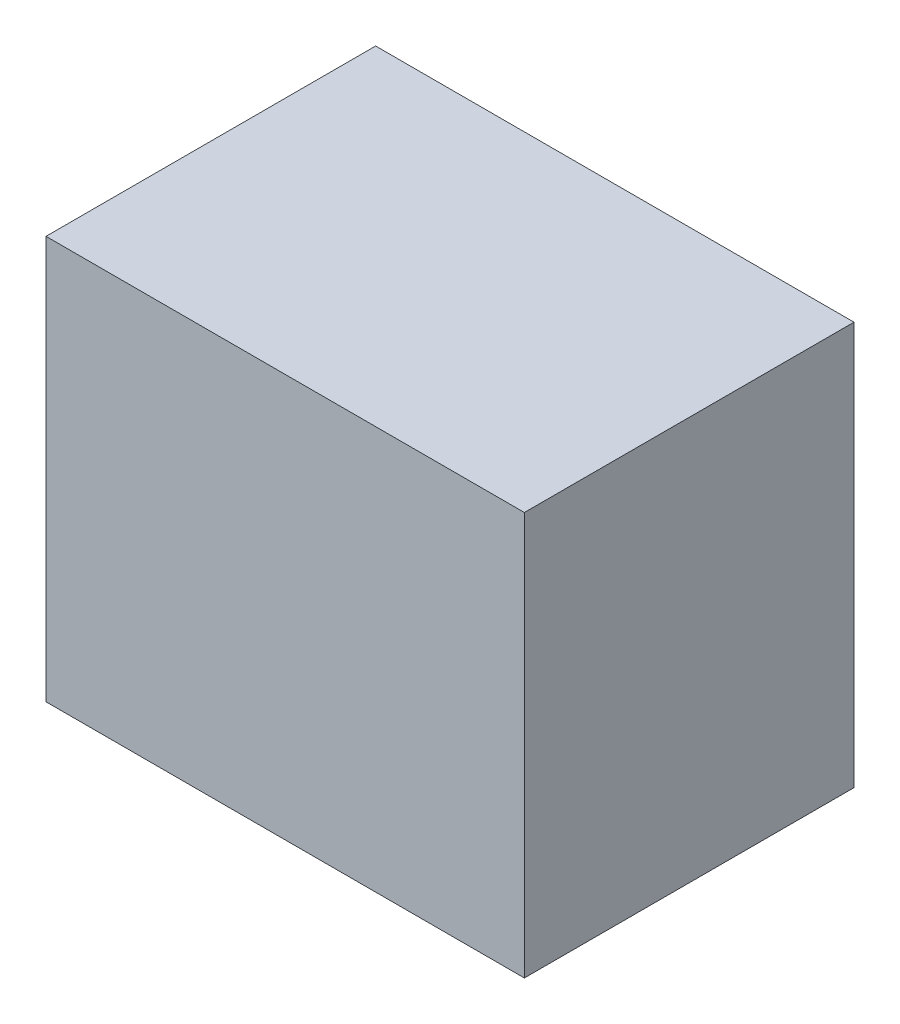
ISO-10303-21;
HEADER;
FILE_DESCRIPTION(('STEP AP214'),'2;1');
FILE_NAME('part.step','',(''),(''),'','','');
FILE_SCHEMA(('AUTOMOTIVE_DESIGN { 1 0 10303 214 1 1 1 1 }'));
ENDSEC;
DATA;
#1=APPLICATION_CONTEXT('core data for automotive mechanical design processes');
#2=APPLICATION_PROTOCOL_DEFINITION('international standard','automotive_design',2000,#1);
#3=PRODUCT_CONTEXT('',#1,'mechanical');
#4=PRODUCT('Part','Part','',(#3));
#5=PRODUCT_RELATED_PRODUCT_CATEGORY('part','',(#4));
#6=PRODUCT_DEFINITION_FORMATION('','',#4);
#7=PRODUCT_DEFINITION_CONTEXT('part definition',#1,'design');
#8=PRODUCT_DEFINITION('design','',#6,#7);
#9=PRODUCT_DEFINITION_SHAPE('','',#8);
#10=(LENGTH_UNIT() NAMED_UNIT(*) SI_UNIT(.MILLI.,.METRE.));
#11=(NAMED_UNIT(*) PLANE_ANGLE_UNIT() SI_UNIT($,.RADIAN.));
#12=(NAMED_UNIT(*) SI_UNIT($,.STERADIAN.) SOLID_ANGLE_UNIT());
#13=UNCERTAINTY_MEASURE_WITH_UNIT(LENGTH_MEASURE(1.E-05),#10,'distance_accuracy_value','');
#14=(GEOMETRIC_REPRESENTATION_CONTEXT(3) GLOBAL_UNCERTAINTY_ASSIGNED_CONTEXT((#13)) GLOBAL_UNIT_ASSIGNED_CONTEXT((#10,
#11,#12)) REPRESENTATION_CONTEXT('',''));
#15=CARTESIAN_POINT('',(0.,0.,0.));
#16=DIRECTION('',(0.,0.,1.));
#17=DIRECTION('',(1.,0.,0.));
#18=AXIS2_PLACEMENT_3D('',#15,#16,#17);
#19=CARTESIAN_POINT('',(0.,0.,50.8));
#20=DIRECTION('',(1.,0.,0.));
#21=DIRECTION('',(0.,0.,-1.));
#22=AXIS2_PLACEMENT_3D('',#19,#20,#21);
#23=PLANE('',#22);
#24=DIRECTION('',(0.,-1.,0.));
#25=VECTOR('',#24,1.);
#26=CARTESIAN_POINT('',(0.,0.,0.));
#27=LINE('',#26,#25);
#28=CARTESIAN_POINT('',(0.,62.1285268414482,0.));
#29=VERTEX_POINT('',#28);
#30=CARTESIAN_POINT('',(0.,0.,0.));
#31=VERTEX_POINT('',#30);
#32=EDGE_CURVE('E96',#29,#31,#27,.T.);
#33=ORIENTED_EDGE('',*,*,#32,.T.);
#34=DIRECTION('',(0.,0.,-1.));
#35=VECTOR('',#34,1.);
#36=CARTESIAN_POINT('',(0.,0.,50.8));
#37=LINE('',#36,#35);
#38=CARTESIAN_POINT('',(0.,0.,50.8));
#39=VERTEX_POINT('',#38);
#40=EDGE_CURVE('E11',#39,#31,#37,.T.);
#41=ORIENTED_EDGE('',*,*,#40,.F.);
#42=DIRECTION('',(0.,-1.,0.));
#43=VECTOR('',#42,1.);
#44=CARTESIAN_POINT('',(0.,0.,50.8));
#45=LINE('',#44,#43);
#46=CARTESIAN_POINT('',(0.,62.1285268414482,50.8));
#47=VERTEX_POINT('',#46);
#48=EDGE_CURVE('E84',#47,#39,#45,.T.);
#49=ORIENTED_EDGE('',*,*,#48,.F.);
#50=DIRECTION('',(0.,0.,-1.));
#51=VECTOR('',#50,1.);
#52=CARTESIAN_POINT('',(0.,62.1285268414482,50.8));
#53=LINE('',#52,#51);
#54=EDGE_CURVE('E92',#47,#29,#53,.T.);
#55=ORIENTED_EDGE('',*,*,#54,.T.);
#56=EDGE_LOOP('',(#33,#41,#49,#55));
#57=FACE_BOUND('',#56,.T.);
#58=ADVANCED_FACE('F33',(#57),#23,.F.);
#59=CARTESIAN_POINT('',(0.,0.,50.8));
#60=DIRECTION('',(0.,1.,0.));
#61=DIRECTION('',(0.,0.,1.));
#62=AXIS2_PLACEMENT_3D('',#59,#60,#61);
#63=PLANE('',#62);
#64=DIRECTION('',(1.,0.,0.));
#65=VECTOR('',#64,1.);
#66=CARTESIAN_POINT('',(0.,0.,0.));
#67=LINE('',#66,#65);
#68=CARTESIAN_POINT('',(73.7197170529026,0.,0.));
#69=VERTEX_POINT('',#68);
#70=EDGE_CURVE('E88',#31,#69,#67,.T.);
#71=ORIENTED_EDGE('',*,*,#70,.T.);
#72=DIRECTION('',(0.,0.,-1.));
#73=VECTOR('',#72,1.);
#74=CARTESIAN_POINT('',(73.7197170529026,0.,50.8));
#75=LINE('',#74,#73);
#76=CARTESIAN_POINT('',(73.7197170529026,0.,50.8));
#77=VERTEX_POINT('',#76);
#78=EDGE_CURVE('E41',#77,#69,#75,.T.);
#79=ORIENTED_EDGE('',*,*,#78,.F.);
#80=DIRECTION('',(1.,0.,0.));
#81=VECTOR('',#80,1.);
#82=CARTESIAN_POINT('',(0.,0.,50.8));
#83=LINE('',#82,#81);
#84=EDGE_CURVE('E79',#39,#77,#83,.T.);
#85=ORIENTED_EDGE('',*,*,#84,.F.);
#86=ORIENTED_EDGE('',*,*,#40,.T.);
#87=EDGE_LOOP('',(#71,#79,#85,#86));
#88=FACE_BOUND('',#87,.T.);
#89=ADVANCED_FACE('F87',(#88),#63,.F.);
#90=CARTESIAN_POINT('',(73.7197170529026,0.,50.8));
#91=DIRECTION('',(-1.,0.,0.));
#92=DIRECTION('',(0.,0.,1.));
#93=AXIS2_PLACEMENT_3D('',#90,#91,#92);
#94=PLANE('',#93);
#95=DIRECTION('',(0.,1.,0.));
#96=VECTOR('',#95,1.);
#97=CARTESIAN_POINT('',(73.7197170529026,0.,0.));
#98=LINE('',#97,#96);
#99=CARTESIAN_POINT('',(73.7197170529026,62.1285268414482,0.));
#100=VERTEX_POINT('',#99);
#101=EDGE_CURVE('E66',#69,#100,#98,.T.);
#102=ORIENTED_EDGE('',*,*,#101,.T.);
#103=DIRECTION('',(0.,0.,-1.));
#104=VECTOR('',#103,1.);
#105=CARTESIAN_POINT('',(73.7197170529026,62.1285268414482,50.8));
#106=LINE('',#105,#104);
#107=CARTESIAN_POINT('',(73.7197170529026,62.1285268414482,50.8));
#108=VERTEX_POINT('',#107);
#109=EDGE_CURVE('E89',#108,#100,#106,.T.);
#110=ORIENTED_EDGE('',*,*,#109,.F.);
#111=DIRECTION('',(0.,1.,0.));
#112=VECTOR('',#111,1.);
#113=CARTESIAN_POINT('',(73.7197170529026,0.,50.8));
#114=LINE('',#113,#112);
#115=EDGE_CURVE('E82',#77,#108,#114,.T.);
#116=ORIENTED_EDGE('',*,*,#115,.F.);
#117=ORIENTED_EDGE('',*,*,#78,.T.);
#118=EDGE_LOOP('',(#102,#110,#116,#117));
#119=FACE_BOUND('',#118,.T.);
#120=ADVANCED_FACE('F90',(#119),#94,.F.);
#121=CARTESIAN_POINT('',(0.,62.1285268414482,50.8));
#122=DIRECTION('',(0.,-1.,0.));
#123=DIRECTION('',(0.,0.,-1.));
#124=AXIS2_PLACEMENT_3D('',#121,#122,#123);
#125=PLANE('',#124);
#126=DIRECTION('',(-1.,0.,0.));
#127=VECTOR('',#126,1.);
#128=CARTESIAN_POINT('',(0.,62.1285268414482,0.));
#129=LINE('',#128,#127);
#130=EDGE_CURVE('E72',#100,#29,#129,.T.);
#131=ORIENTED_EDGE('',*,*,#130,.T.);
#132=ORIENTED_EDGE('',*,*,#54,.F.);
#133=DIRECTION('',(-1.,0.,0.));
#134=VECTOR('',#133,1.);
#135=CARTESIAN_POINT('',(0.,62.1285268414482,50.8));
#136=LINE('',#135,#134);
#137=EDGE_CURVE('E49',#108,#47,#136,.T.);
#138=ORIENTED_EDGE('',*,*,#137,.F.);
#139=ORIENTED_EDGE('',*,*,#109,.T.);
#140=EDGE_LOOP('',(#131,#132,#138,#139));
#141=FACE_BOUND('',#140,.T.);
#142=ADVANCED_FACE('F103',(#141),#125,.F.);
#143=CARTESIAN_POINT('',(0.,62.1285268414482,50.8));
#144=DIRECTION('',(0.,0.,-1.));
#145=DIRECTION('',(-1.,0.,0.));
#146=AXIS2_PLACEMENT_3D('',#143,#144,#145);
#147=PLANE('',#146);
#148=ORIENTED_EDGE('',*,*,#48,.T.);
#149=ORIENTED_EDGE('',*,*,#84,.T.);
#150=ORIENTED_EDGE('',*,*,#115,.T.);
#151=ORIENTED_EDGE('',*,*,#137,.T.);
#152=EDGE_LOOP('',(#148,#149,#150,#151));
#153=FACE_BOUND('',#152,.T.);
#154=ADVANCED_FACE('F80',(#153),#147,.F.);
#155=CARTESIAN_POINT('',(0.,62.1285268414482,0.));
#156=DIRECTION('',(0.,0.,-1.));
#157=DIRECTION('',(-1.,0.,0.));
#158=AXIS2_PLACEMENT_3D('',#155,#156,#157);
#159=PLANE('',#158);
#160=ORIENTED_EDGE('',*,*,#32,.F.);
#161=ORIENTED_EDGE('',*,*,#130,.F.);
#162=ORIENTED_EDGE('',*,*,#101,.F.);
#163=ORIENTED_EDGE('',*,*,#70,.F.);
#164=EDGE_LOOP('',(#160,#161,#162,#163));
#165=FACE_BOUND('',#164,.T.);
#166=ADVANCED_FACE('F106',(#165),#159,.T.);
#167=CLOSED_SHELL('',(#58,#89,#120,#142,#154,#166));
#168=MANIFOLD_SOLID_BREP('B2',#167);
#169=ADVANCED_BREP_SHAPE_REPRESENTATION('',(#18,#168),#14);
#170=SHAPE_DEFINITION_REPRESENTATION(#9,#169);
ENDSEC;
END-ISO-10303-21;
